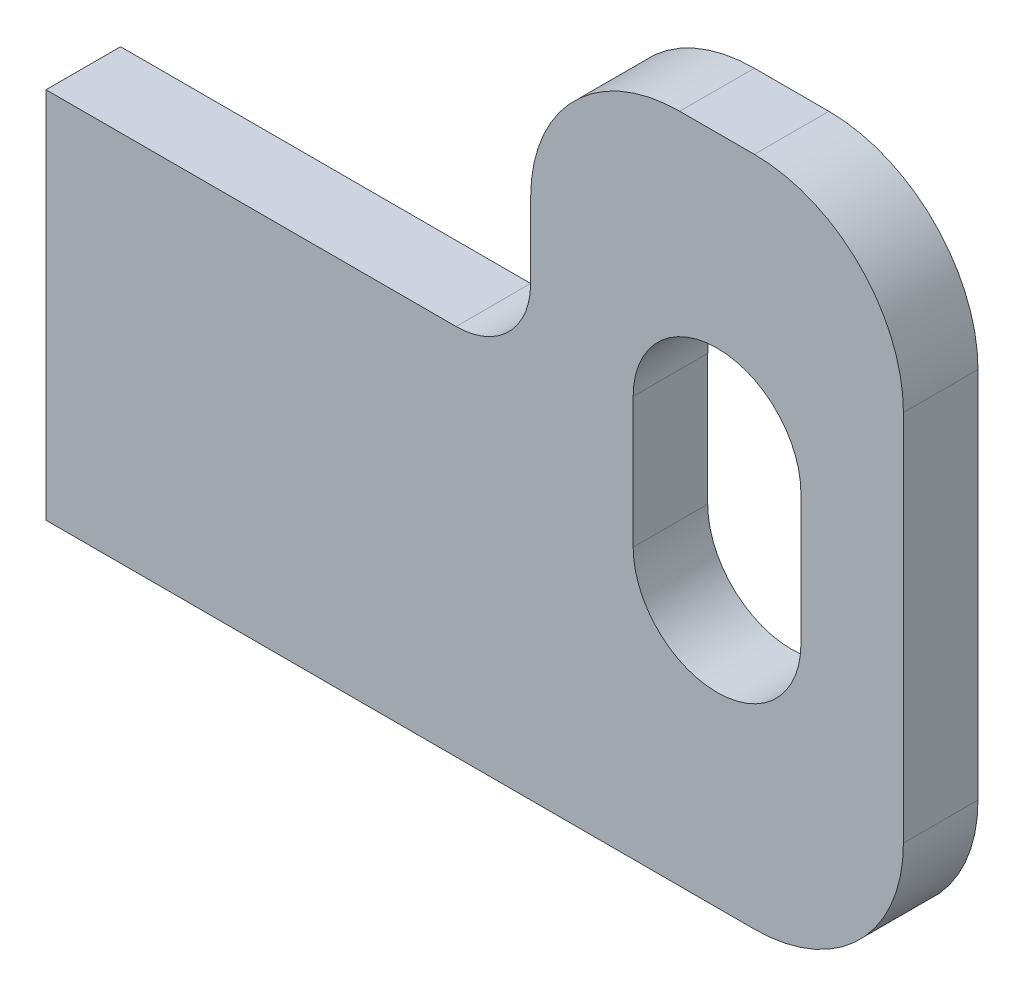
ISO-10303-21;
HEADER;
FILE_DESCRIPTION(('STEP AP214'),'2;1');
FILE_NAME('part.step','',(''),(''),'','','');
FILE_SCHEMA(('AUTOMOTIVE_DESIGN { 1 0 10303 214 1 1 1 1 }'));
ENDSEC;
DATA;
#1=APPLICATION_CONTEXT('core data for automotive mechanical design processes');
#2=APPLICATION_PROTOCOL_DEFINITION('international standard','automotive_design',2000,#1);
#3=PRODUCT_CONTEXT('',#1,'mechanical');
#4=PRODUCT('Part','Part','',(#3));
#5=PRODUCT_RELATED_PRODUCT_CATEGORY('part','',(#4));
#6=PRODUCT_DEFINITION_FORMATION('','',#4);
#7=PRODUCT_DEFINITION_CONTEXT('part definition',#1,'design');
#8=PRODUCT_DEFINITION('design','',#6,#7);
#9=PRODUCT_DEFINITION_SHAPE('','',#8);
#10=(LENGTH_UNIT() NAMED_UNIT(*) SI_UNIT(.MILLI.,.METRE.));
#11=(NAMED_UNIT(*) PLANE_ANGLE_UNIT() SI_UNIT($,.RADIAN.));
#12=(NAMED_UNIT(*) SI_UNIT($,.STERADIAN.) SOLID_ANGLE_UNIT());
#13=UNCERTAINTY_MEASURE_WITH_UNIT(LENGTH_MEASURE(1.E-05),#10,'distance_accuracy_value','');
#14=(GEOMETRIC_REPRESENTATION_CONTEXT(3) GLOBAL_UNCERTAINTY_ASSIGNED_CONTEXT((#13)) GLOBAL_UNIT_ASSIGNED_CONTEXT((#10,
#11,#12)) REPRESENTATION_CONTEXT('',''));
#15=CARTESIAN_POINT('',(0.,0.,0.));
#16=DIRECTION('',(0.,0.,1.));
#17=DIRECTION('',(1.,0.,0.));
#18=AXIS2_PLACEMENT_3D('',#15,#16,#17);
#19=CARTESIAN_POINT('',(264.741762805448,163.075378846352,6.35000000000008));
#20=DIRECTION('',(0.,0.,1.));
#21=DIRECTION('',(1.,0.,0.));
#22=AXIS2_PLACEMENT_3D('',#19,#20,#21);
#23=PLANE('',#22);
#24=CARTESIAN_POINT('',(264.741762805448,163.075378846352,6.35000000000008));
#25=DIRECTION('',(0.,0.,-1.));
#26=DIRECTION('',(1.,0.,0.));
#27=AXIS2_PLACEMENT_3D('',#24,#25,#26);
#28=CIRCLE('',#27,6.35000000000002);
#29=CARTESIAN_POINT('',(271.091762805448,163.075378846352,6.35000000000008));
#30=VERTEX_POINT('',#29);
#31=CARTESIAN_POINT('',(264.741762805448,156.725378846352,6.35000000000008));
#32=VERTEX_POINT('',#31);
#33=EDGE_CURVE('E169',#30,#32,#28,.T.);
#34=ORIENTED_EDGE('',*,*,#33,.T.);
#35=DIRECTION('',(-1.,0.,0.));
#36=VECTOR('',#35,1.);
#37=CARTESIAN_POINT('',(264.741762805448,156.725378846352,6.35000000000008));
#38=LINE('',#37,#36);
#39=CARTESIAN_POINT('',(229.816762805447,156.725378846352,6.34999999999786));
#40=VERTEX_POINT('',#39);
#41=EDGE_CURVE('E172',#32,#40,#38,.T.);
#42=ORIENTED_EDGE('',*,*,#41,.T.);
#43=DIRECTION('',(0.,-1.,0.));
#44=VECTOR('',#43,1.);
#45=CARTESIAN_POINT('',(229.816762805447,156.725378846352,6.34999999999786));
#46=LINE('',#45,#44);
#47=CARTESIAN_POINT('',(229.816762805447,124.975378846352,6.34999999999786));
#48=VERTEX_POINT('',#47);
#49=EDGE_CURVE('E175',#40,#48,#46,.T.);
#50=ORIENTED_EDGE('',*,*,#49,.T.);
#51=DIRECTION('',(1.,0.,0.));
#52=VECTOR('',#51,1.);
#53=CARTESIAN_POINT('',(229.816762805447,124.975378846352,6.34999999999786));
#54=LINE('',#53,#52);
#55=CARTESIAN_POINT('',(290.141762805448,124.975378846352,6.35000000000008));
#56=VERTEX_POINT('',#55);
#57=EDGE_CURVE('E177',#48,#56,#54,.T.);
#58=ORIENTED_EDGE('',*,*,#57,.T.);
#59=CARTESIAN_POINT('',(290.141762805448,137.675378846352,6.35000000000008));
#60=DIRECTION('',(0.,0.,1.));
#61=DIRECTION('',(1.,0.,0.));
#62=AXIS2_PLACEMENT_3D('',#59,#60,#61);
#63=CIRCLE('',#62,12.7);
#64=CARTESIAN_POINT('',(302.841762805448,137.675378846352,6.35000000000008));
#65=VERTEX_POINT('',#64);
#66=EDGE_CURVE('E179',#56,#65,#63,.T.);
#67=ORIENTED_EDGE('',*,*,#66,.T.);
#68=DIRECTION('',(0.,1.,0.));
#69=VECTOR('',#68,1.);
#70=CARTESIAN_POINT('',(302.841762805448,137.675378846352,6.35000000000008));
#71=LINE('',#70,#69);
#72=CARTESIAN_POINT('',(302.841762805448,169.425378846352,6.35000000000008));
#73=VERTEX_POINT('',#72);
#74=EDGE_CURVE('E181',#65,#73,#71,.T.);
#75=ORIENTED_EDGE('',*,*,#74,.T.);
#76=CARTESIAN_POINT('',(290.141762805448,169.425378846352,6.35000000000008));
#77=DIRECTION('',(0.,0.,1.));
#78=DIRECTION('',(1.,0.,0.));
#79=AXIS2_PLACEMENT_3D('',#76,#77,#78);
#80=CIRCLE('',#79,12.7);
#81=CARTESIAN_POINT('',(290.141762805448,182.125378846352,6.35000000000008));
#82=VERTEX_POINT('',#81);
#83=EDGE_CURVE('E183',#73,#82,#80,.T.);
#84=ORIENTED_EDGE('',*,*,#83,.T.);
#85=DIRECTION('',(-1.,0.,0.));
#86=VECTOR('',#85,1.);
#87=CARTESIAN_POINT('',(290.141762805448,182.125378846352,6.35000000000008));
#88=LINE('',#87,#86);
#89=CARTESIAN_POINT('',(283.791762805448,182.125378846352,6.35000000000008));
#90=VERTEX_POINT('',#89);
#91=EDGE_CURVE('E185',#82,#90,#88,.T.);
#92=ORIENTED_EDGE('',*,*,#91,.T.);
#93=CARTESIAN_POINT('',(283.791762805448,169.425378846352,6.35000000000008));
#94=DIRECTION('',(0.,0.,1.));
#95=DIRECTION('',(1.,0.,0.));
#96=AXIS2_PLACEMENT_3D('',#93,#94,#95);
#97=CIRCLE('',#96,12.7);
#98=CARTESIAN_POINT('',(271.091762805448,169.425378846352,6.35000000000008));
#99=VERTEX_POINT('',#98);
#100=EDGE_CURVE('E187',#90,#99,#97,.T.);
#101=ORIENTED_EDGE('',*,*,#100,.T.);
#102=DIRECTION('',(0.,-1.,0.));
#103=VECTOR('',#102,1.);
#104=CARTESIAN_POINT('',(271.091762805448,169.425378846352,6.35000000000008));
#105=LINE('',#104,#103);
#106=EDGE_CURVE('E189',#99,#30,#105,.T.);
#107=ORIENTED_EDGE('',*,*,#106,.T.);
#108=EDGE_LOOP('',(#34,#42,#50,#58,#67,#75,#84,#92,#101,#107));
#109=FACE_BOUND('',#108,.T.);
#110=DIRECTION('',(0.,1.,0.));
#111=VECTOR('',#110,1.);
#112=CARTESIAN_POINT('',(294.111053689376,147.993152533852,6.35000000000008));
#113=LINE('',#112,#111);
#114=CARTESIAN_POINT('',(294.111053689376,147.993152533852,6.35000000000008));
#115=VERTEX_POINT('',#114);
#116=CARTESIAN_POINT('',(294.111053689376,159.105652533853,6.35000000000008));
#117=VERTEX_POINT('',#116);
#118=EDGE_CURVE('E141',#115,#117,#113,.T.);
#119=ORIENTED_EDGE('',*,*,#118,.F.);
#120=CARTESIAN_POINT('',(286.967303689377,147.993152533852,6.35000000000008));
#121=DIRECTION('',(0.,0.,1.));
#122=DIRECTION('',(1.,0.,0.));
#123=AXIS2_PLACEMENT_3D('',#120,#121,#122);
#124=CIRCLE('',#123,7.14374999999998);
#125=CARTESIAN_POINT('',(279.823553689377,147.993152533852,6.35000000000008));
#126=VERTEX_POINT('',#125);
#127=EDGE_CURVE('E133',#126,#115,#124,.T.);
#128=ORIENTED_EDGE('',*,*,#127,.F.);
#129=DIRECTION('',(0.,-1.,0.));
#130=VECTOR('',#129,1.);
#131=CARTESIAN_POINT('',(279.823553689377,159.105652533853,6.35000000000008));
#132=LINE('',#131,#130);
#133=CARTESIAN_POINT('',(279.823553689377,159.105652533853,6.35000000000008));
#134=VERTEX_POINT('',#133);
#135=EDGE_CURVE('E155',#134,#126,#132,.T.);
#136=ORIENTED_EDGE('',*,*,#135,.F.);
#137=CARTESIAN_POINT('',(286.967303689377,159.105652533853,6.35000000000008));
#138=DIRECTION('',(0.,0.,1.));
#139=DIRECTION('',(1.,0.,0.));
#140=AXIS2_PLACEMENT_3D('',#137,#138,#139);
#141=CIRCLE('',#140,7.14374999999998);
#142=EDGE_CURVE('E153',#117,#134,#141,.T.);
#143=ORIENTED_EDGE('',*,*,#142,.F.);
#144=EDGE_LOOP('',(#119,#128,#136,#143));
#145=FACE_BOUND('',#144,.T.);
#146=ADVANCED_FACE('F32',(#109,#145),#23,.T.);
#147=CARTESIAN_POINT('',(264.741762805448,163.075378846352,0.));
#148=DIRECTION('',(0.,0.,1.));
#149=DIRECTION('',(1.,0.,0.));
#150=AXIS2_PLACEMENT_3D('',#147,#148,#149);
#151=PLANE('',#150);
#152=CARTESIAN_POINT('',(264.741762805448,163.075378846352,0.));
#153=DIRECTION('',(0.,0.,-1.));
#154=DIRECTION('',(1.,0.,0.));
#155=AXIS2_PLACEMENT_3D('',#152,#153,#154);
#156=CIRCLE('',#155,6.35000000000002);
#157=CARTESIAN_POINT('',(271.091762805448,163.075378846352,0.));
#158=VERTEX_POINT('',#157);
#159=CARTESIAN_POINT('',(264.741762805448,156.725378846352,0.));
#160=VERTEX_POINT('',#159);
#161=EDGE_CURVE('E149',#158,#160,#156,.T.);
#162=ORIENTED_EDGE('',*,*,#161,.F.);
#163=DIRECTION('',(0.,-1.,0.));
#164=VECTOR('',#163,1.);
#165=CARTESIAN_POINT('',(271.091762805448,169.425378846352,0.));
#166=LINE('',#165,#164);
#167=CARTESIAN_POINT('',(271.091762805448,169.425378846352,0.));
#168=VERTEX_POINT('',#167);
#169=EDGE_CURVE('E173',#168,#158,#166,.T.);
#170=ORIENTED_EDGE('',*,*,#169,.F.);
#171=CARTESIAN_POINT('',(283.791762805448,169.425378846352,0.));
#172=DIRECTION('',(0.,0.,1.));
#173=DIRECTION('',(1.,0.,0.));
#174=AXIS2_PLACEMENT_3D('',#171,#172,#173);
#175=CIRCLE('',#174,12.7);
#176=CARTESIAN_POINT('',(283.791762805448,182.125378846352,0.));
#177=VERTEX_POINT('',#176);
#178=EDGE_CURVE('E208',#177,#168,#175,.T.);
#179=ORIENTED_EDGE('',*,*,#178,.F.);
#180=DIRECTION('',(-1.,0.,0.));
#181=VECTOR('',#180,1.);
#182=CARTESIAN_POINT('',(290.141762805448,182.125378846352,0.));
#183=LINE('',#182,#181);
#184=CARTESIAN_POINT('',(290.141762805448,182.125378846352,0.));
#185=VERTEX_POINT('',#184);
#186=EDGE_CURVE('E206',#185,#177,#183,.T.);
#187=ORIENTED_EDGE('',*,*,#186,.F.);
#188=CARTESIAN_POINT('',(290.141762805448,169.425378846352,0.));
#189=DIRECTION('',(0.,0.,1.));
#190=DIRECTION('',(1.,0.,0.));
#191=AXIS2_PLACEMENT_3D('',#188,#189,#190);
#192=CIRCLE('',#191,12.7);
#193=CARTESIAN_POINT('',(302.841762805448,169.425378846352,0.));
#194=VERTEX_POINT('',#193);
#195=EDGE_CURVE('E204',#194,#185,#192,.T.);
#196=ORIENTED_EDGE('',*,*,#195,.F.);
#197=DIRECTION('',(0.,1.,0.));
#198=VECTOR('',#197,1.);
#199=CARTESIAN_POINT('',(302.841762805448,137.675378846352,0.));
#200=LINE('',#199,#198);
#201=CARTESIAN_POINT('',(302.841762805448,137.675378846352,0.));
#202=VERTEX_POINT('',#201);
#203=EDGE_CURVE('E202',#202,#194,#200,.T.);
#204=ORIENTED_EDGE('',*,*,#203,.F.);
#205=CARTESIAN_POINT('',(290.141762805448,137.675378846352,0.));
#206=DIRECTION('',(0.,0.,1.));
#207=DIRECTION('',(1.,0.,0.));
#208=AXIS2_PLACEMENT_3D('',#205,#206,#207);
#209=CIRCLE('',#208,12.7);
#210=CARTESIAN_POINT('',(290.141762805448,124.975378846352,0.));
#211=VERTEX_POINT('',#210);
#212=EDGE_CURVE('E200',#211,#202,#209,.T.);
#213=ORIENTED_EDGE('',*,*,#212,.F.);
#214=DIRECTION('',(1.,0.,0.));
#215=VECTOR('',#214,1.);
#216=CARTESIAN_POINT('',(229.816762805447,124.975378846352,-2.22044604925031E-12));
#217=LINE('',#216,#215);
#218=CARTESIAN_POINT('',(229.816762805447,124.975378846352,-2.22044604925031E-12));
#219=VERTEX_POINT('',#218);
#220=EDGE_CURVE('E198',#219,#211,#217,.T.);
#221=ORIENTED_EDGE('',*,*,#220,.F.);
#222=DIRECTION('',(0.,-1.,0.));
#223=VECTOR('',#222,1.);
#224=CARTESIAN_POINT('',(229.816762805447,156.725378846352,-2.22044604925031E-12));
#225=LINE('',#224,#223);
#226=CARTESIAN_POINT('',(229.816762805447,156.725378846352,-2.22044604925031E-12));
#227=VERTEX_POINT('',#226);
#228=EDGE_CURVE('E196',#227,#219,#225,.T.);
#229=ORIENTED_EDGE('',*,*,#228,.F.);
#230=DIRECTION('',(-1.,0.,0.));
#231=VECTOR('',#230,1.);
#232=CARTESIAN_POINT('',(264.741762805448,156.725378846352,0.));
#233=LINE('',#232,#231);
#234=EDGE_CURVE('E194',#160,#227,#233,.T.);
#235=ORIENTED_EDGE('',*,*,#234,.F.);
#236=EDGE_LOOP('',(#162,#170,#179,#187,#196,#204,#213,#221,#229,#235));
#237=FACE_BOUND('',#236,.T.);
#238=CARTESIAN_POINT('',(286.967303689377,147.993152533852,0.));
#239=DIRECTION('',(0.,0.,1.));
#240=DIRECTION('',(1.,0.,0.));
#241=AXIS2_PLACEMENT_3D('',#238,#239,#240);
#242=CIRCLE('',#241,7.14374999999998);
#243=CARTESIAN_POINT('',(279.823553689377,147.993152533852,0.));
#244=VERTEX_POINT('',#243);
#245=CARTESIAN_POINT('',(294.111053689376,147.993152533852,0.));
#246=VERTEX_POINT('',#245);
#247=EDGE_CURVE('E55',#244,#246,#242,.T.);
#248=ORIENTED_EDGE('',*,*,#247,.T.);
#249=DIRECTION('',(0.,1.,0.));
#250=VECTOR('',#249,1.);
#251=CARTESIAN_POINT('',(294.111053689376,147.993152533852,0.));
#252=LINE('',#251,#250);
#253=CARTESIAN_POINT('',(294.111053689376,159.105652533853,0.));
#254=VERTEX_POINT('',#253);
#255=EDGE_CURVE('E148',#246,#254,#252,.T.);
#256=ORIENTED_EDGE('',*,*,#255,.T.);
#257=CARTESIAN_POINT('',(286.967303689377,159.105652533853,0.));
#258=DIRECTION('',(0.,0.,1.));
#259=DIRECTION('',(1.,0.,0.));
#260=AXIS2_PLACEMENT_3D('',#257,#258,#259);
#261=CIRCLE('',#260,7.14374999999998);
#262=CARTESIAN_POINT('',(279.823553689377,159.105652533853,0.));
#263=VERTEX_POINT('',#262);
#264=EDGE_CURVE('E161',#254,#263,#261,.T.);
#265=ORIENTED_EDGE('',*,*,#264,.T.);
#266=DIRECTION('',(0.,-1.,0.));
#267=VECTOR('',#266,1.);
#268=CARTESIAN_POINT('',(279.823553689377,159.105652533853,0.));
#269=LINE('',#268,#267);
#270=EDGE_CURVE('E142',#263,#244,#269,.T.);
#271=ORIENTED_EDGE('',*,*,#270,.T.);
#272=EDGE_LOOP('',(#248,#256,#265,#271));
#273=FACE_BOUND('',#272,.T.);
#274=ADVANCED_FACE('F244',(#237,#273),#151,.F.);
#275=CARTESIAN_POINT('',(264.741762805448,163.075378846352,6.35000000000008));
#276=DIRECTION('',(0.,0.,-1.));
#277=DIRECTION('',(-1.,0.,0.));
#278=AXIS2_PLACEMENT_3D('',#275,#276,#277);
#279=CYLINDRICAL_SURFACE('',#278,6.35000000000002);
#280=ORIENTED_EDGE('',*,*,#161,.T.);
#281=DIRECTION('',(0.,0.,-1.));
#282=VECTOR('',#281,1.);
#283=CARTESIAN_POINT('',(264.741762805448,156.725378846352,6.35000000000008));
#284=LINE('',#283,#282);
#285=EDGE_CURVE('E11',#32,#160,#284,.T.);
#286=ORIENTED_EDGE('',*,*,#285,.F.);
#287=ORIENTED_EDGE('',*,*,#33,.F.);
#288=DIRECTION('',(0.,0.,-1.));
#289=VECTOR('',#288,1.);
#290=CARTESIAN_POINT('',(271.091762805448,163.075378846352,6.35000000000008));
#291=LINE('',#290,#289);
#292=EDGE_CURVE('E191',#30,#158,#291,.T.);
#293=ORIENTED_EDGE('',*,*,#292,.T.);
#294=EDGE_LOOP('',(#280,#286,#287,#293));
#295=FACE_BOUND('',#294,.T.);
#296=ADVANCED_FACE('F34',(#295),#279,.F.);
#297=CARTESIAN_POINT('',(264.741762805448,156.725378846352,6.35000000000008));
#298=DIRECTION('',(0.,-1.,0.));
#299=DIRECTION('',(1.,0.,0.));
#300=AXIS2_PLACEMENT_3D('',#297,#298,#299);
#301=PLANE('',#300);
#302=ORIENTED_EDGE('',*,*,#234,.T.);
#303=DIRECTION('',(0.,0.,-1.));
#304=VECTOR('',#303,1.);
#305=CARTESIAN_POINT('',(229.816762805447,156.725378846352,6.34999999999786));
#306=LINE('',#305,#304);
#307=EDGE_CURVE('E40',#40,#227,#306,.T.);
#308=ORIENTED_EDGE('',*,*,#307,.F.);
#309=ORIENTED_EDGE('',*,*,#41,.F.);
#310=ORIENTED_EDGE('',*,*,#285,.T.);
#311=EDGE_LOOP('',(#302,#308,#309,#310));
#312=FACE_BOUND('',#311,.T.);
#313=ADVANCED_FACE('F261',(#312),#301,.F.);
#314=CARTESIAN_POINT('',(229.816762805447,156.725378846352,6.34999999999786));
#315=DIRECTION('',(1.,0.,0.));
#316=DIRECTION('',(0.,0.,-1.));
#317=AXIS2_PLACEMENT_3D('',#314,#315,#316);
#318=PLANE('',#317);
#319=ORIENTED_EDGE('',*,*,#228,.T.);
#320=DIRECTION('',(0.,0.,-1.));
#321=VECTOR('',#320,1.);
#322=CARTESIAN_POINT('',(229.816762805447,124.975378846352,6.34999999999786));
#323=LINE('',#322,#321);
#324=EDGE_CURVE('E231',#48,#219,#323,.T.);
#325=ORIENTED_EDGE('',*,*,#324,.F.);
#326=ORIENTED_EDGE('',*,*,#49,.F.);
#327=ORIENTED_EDGE('',*,*,#307,.T.);
#328=EDGE_LOOP('',(#319,#325,#326,#327));
#329=FACE_BOUND('',#328,.T.);
#330=ADVANCED_FACE('F238',(#329),#318,.F.);
#331=CARTESIAN_POINT('',(229.816762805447,124.975378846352,6.34999999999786));
#332=DIRECTION('',(0.,1.,0.));
#333=DIRECTION('',(-1.,0.,0.));
#334=AXIS2_PLACEMENT_3D('',#331,#332,#333);
#335=PLANE('',#334);
#336=ORIENTED_EDGE('',*,*,#220,.T.);
#337=DIRECTION('',(0.,0.,-1.));
#338=VECTOR('',#337,1.);
#339=CARTESIAN_POINT('',(290.141762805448,124.975378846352,6.35000000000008));
#340=LINE('',#339,#338);
#341=EDGE_CURVE('E228',#56,#211,#340,.T.);
#342=ORIENTED_EDGE('',*,*,#341,.F.);
#343=ORIENTED_EDGE('',*,*,#57,.F.);
#344=ORIENTED_EDGE('',*,*,#324,.T.);
#345=EDGE_LOOP('',(#336,#342,#343,#344));
#346=FACE_BOUND('',#345,.T.);
#347=ADVANCED_FACE('F250',(#346),#335,.F.);
#348=CARTESIAN_POINT('',(290.141762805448,137.675378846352,6.35000000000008));
#349=DIRECTION('',(0.,0.,-1.));
#350=DIRECTION('',(-1.,0.,0.));
#351=AXIS2_PLACEMENT_3D('',#348,#349,#350);
#352=CYLINDRICAL_SURFACE('',#351,12.7);
#353=ORIENTED_EDGE('',*,*,#212,.T.);
#354=DIRECTION('',(0.,0.,-1.));
#355=VECTOR('',#354,1.);
#356=CARTESIAN_POINT('',(302.841762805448,137.675378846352,6.35000000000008));
#357=LINE('',#356,#355);
#358=EDGE_CURVE('E225',#65,#202,#357,.T.);
#359=ORIENTED_EDGE('',*,*,#358,.F.);
#360=ORIENTED_EDGE('',*,*,#66,.F.);
#361=ORIENTED_EDGE('',*,*,#341,.T.);
#362=EDGE_LOOP('',(#353,#359,#360,#361));
#363=FACE_BOUND('',#362,.T.);
#364=ADVANCED_FACE('F254',(#363),#352,.T.);
#365=CARTESIAN_POINT('',(302.841762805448,137.675378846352,6.35000000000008));
#366=DIRECTION('',(-1.,0.,0.));
#367=DIRECTION('',(0.,0.,1.));
#368=AXIS2_PLACEMENT_3D('',#365,#366,#367);
#369=PLANE('',#368);
#370=ORIENTED_EDGE('',*,*,#203,.T.);
#371=DIRECTION('',(0.,0.,-1.));
#372=VECTOR('',#371,1.);
#373=CARTESIAN_POINT('',(302.841762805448,169.425378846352,6.35000000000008));
#374=LINE('',#373,#372);
#375=EDGE_CURVE('E222',#73,#194,#374,.T.);
#376=ORIENTED_EDGE('',*,*,#375,.F.);
#377=ORIENTED_EDGE('',*,*,#74,.F.);
#378=ORIENTED_EDGE('',*,*,#358,.T.);
#379=EDGE_LOOP('',(#370,#376,#377,#378));
#380=FACE_BOUND('',#379,.T.);
#381=ADVANCED_FACE('F284',(#380),#369,.F.);
#382=CARTESIAN_POINT('',(290.141762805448,169.425378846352,6.35000000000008));
#383=DIRECTION('',(0.,0.,-1.));
#384=DIRECTION('',(-1.,0.,0.));
#385=AXIS2_PLACEMENT_3D('',#382,#383,#384);
#386=CYLINDRICAL_SURFACE('',#385,12.7);
#387=ORIENTED_EDGE('',*,*,#195,.T.);
#388=DIRECTION('',(0.,0.,-1.));
#389=VECTOR('',#388,1.);
#390=CARTESIAN_POINT('',(290.141762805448,182.125378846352,6.35000000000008));
#391=LINE('',#390,#389);
#392=EDGE_CURVE('E219',#82,#185,#391,.T.);
#393=ORIENTED_EDGE('',*,*,#392,.F.);
#394=ORIENTED_EDGE('',*,*,#83,.F.);
#395=ORIENTED_EDGE('',*,*,#375,.T.);
#396=EDGE_LOOP('',(#387,#393,#394,#395));
#397=FACE_BOUND('',#396,.T.);
#398=ADVANCED_FACE('F281',(#397),#386,.T.);
#399=CARTESIAN_POINT('',(290.141762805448,182.125378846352,6.35000000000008));
#400=DIRECTION('',(0.,-1.,0.));
#401=DIRECTION('',(0.,0.,-1.));
#402=AXIS2_PLACEMENT_3D('',#399,#400,#401);
#403=PLANE('',#402);
#404=ORIENTED_EDGE('',*,*,#186,.T.);
#405=DIRECTION('',(0.,0.,-1.));
#406=VECTOR('',#405,1.);
#407=CARTESIAN_POINT('',(283.791762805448,182.125378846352,6.35000000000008));
#408=LINE('',#407,#406);
#409=EDGE_CURVE('E216',#90,#177,#408,.T.);
#410=ORIENTED_EDGE('',*,*,#409,.F.);
#411=ORIENTED_EDGE('',*,*,#91,.F.);
#412=ORIENTED_EDGE('',*,*,#392,.T.);
#413=EDGE_LOOP('',(#404,#410,#411,#412));
#414=FACE_BOUND('',#413,.T.);
#415=ADVANCED_FACE('F277',(#414),#403,.F.);
#416=CARTESIAN_POINT('',(283.791762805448,169.425378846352,6.35000000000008));
#417=DIRECTION('',(0.,0.,-1.));
#418=DIRECTION('',(-1.,0.,0.));
#419=AXIS2_PLACEMENT_3D('',#416,#417,#418);
#420=CYLINDRICAL_SURFACE('',#419,12.7);
#421=ORIENTED_EDGE('',*,*,#178,.T.);
#422=DIRECTION('',(0.,0.,-1.));
#423=VECTOR('',#422,1.);
#424=CARTESIAN_POINT('',(271.091762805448,169.425378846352,6.35000000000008));
#425=LINE('',#424,#423);
#426=EDGE_CURVE('E213',#99,#168,#425,.T.);
#427=ORIENTED_EDGE('',*,*,#426,.F.);
#428=ORIENTED_EDGE('',*,*,#100,.F.);
#429=ORIENTED_EDGE('',*,*,#409,.T.);
#430=EDGE_LOOP('',(#421,#427,#428,#429));
#431=FACE_BOUND('',#430,.T.);
#432=ADVANCED_FACE('F273',(#431),#420,.T.);
#433=CARTESIAN_POINT('',(271.091762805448,169.425378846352,6.35000000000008));
#434=DIRECTION('',(1.,0.,0.));
#435=DIRECTION('',(0.,0.,-1.));
#436=AXIS2_PLACEMENT_3D('',#433,#434,#435);
#437=PLANE('',#436);
#438=ORIENTED_EDGE('',*,*,#169,.T.);
#439=ORIENTED_EDGE('',*,*,#292,.F.);
#440=ORIENTED_EDGE('',*,*,#106,.F.);
#441=ORIENTED_EDGE('',*,*,#426,.T.);
#442=EDGE_LOOP('',(#438,#439,#440,#441));
#443=FACE_BOUND('',#442,.T.);
#444=ADVANCED_FACE('F268',(#443),#437,.F.);
#445=CARTESIAN_POINT('',(286.967303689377,147.993152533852,6.35000000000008));
#446=DIRECTION('',(0.,0.,-1.));
#447=DIRECTION('',(-1.,0.,0.));
#448=AXIS2_PLACEMENT_3D('',#445,#446,#447);
#449=CYLINDRICAL_SURFACE('',#448,7.14374999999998);
#450=ORIENTED_EDGE('',*,*,#247,.F.);
#451=DIRECTION('',(0.,0.,-1.));
#452=VECTOR('',#451,1.);
#453=CARTESIAN_POINT('',(279.823553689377,147.993152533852,6.35000000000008));
#454=LINE('',#453,#452);
#455=EDGE_CURVE('E137',#126,#244,#454,.T.);
#456=ORIENTED_EDGE('',*,*,#455,.F.);
#457=ORIENTED_EDGE('',*,*,#127,.T.);
#458=DIRECTION('',(0.,0.,-1.));
#459=VECTOR('',#458,1.);
#460=CARTESIAN_POINT('',(294.111053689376,147.993152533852,6.35000000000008));
#461=LINE('',#460,#459);
#462=EDGE_CURVE('E136',#115,#246,#461,.T.);
#463=ORIENTED_EDGE('',*,*,#462,.T.);
#464=EDGE_LOOP('',(#450,#456,#457,#463));
#465=FACE_BOUND('',#464,.T.);
#466=ADVANCED_FACE('F135',(#465),#449,.F.);
#467=CARTESIAN_POINT('',(294.111053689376,147.993152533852,6.35000000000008));
#468=DIRECTION('',(-1.,0.,0.));
#469=DIRECTION('',(0.,0.,1.));
#470=AXIS2_PLACEMENT_3D('',#467,#468,#469);
#471=PLANE('',#470);
#472=ORIENTED_EDGE('',*,*,#255,.F.);
#473=ORIENTED_EDGE('',*,*,#462,.F.);
#474=ORIENTED_EDGE('',*,*,#118,.T.);
#475=DIRECTION('',(0.,0.,-1.));
#476=VECTOR('',#475,1.);
#477=CARTESIAN_POINT('',(294.111053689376,159.105652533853,6.35000000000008));
#478=LINE('',#477,#476);
#479=EDGE_CURVE('E150',#117,#254,#478,.T.);
#480=ORIENTED_EDGE('',*,*,#479,.T.);
#481=EDGE_LOOP('',(#472,#473,#474,#480));
#482=FACE_BOUND('',#481,.T.);
#483=ADVANCED_FACE('F145',(#482),#471,.T.);
#484=CARTESIAN_POINT('',(286.967303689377,159.105652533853,6.35000000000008));
#485=DIRECTION('',(0.,0.,-1.));
#486=DIRECTION('',(-1.,0.,0.));
#487=AXIS2_PLACEMENT_3D('',#484,#485,#486);
#488=CYLINDRICAL_SURFACE('',#487,7.14374999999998);
#489=ORIENTED_EDGE('',*,*,#264,.F.);
#490=ORIENTED_EDGE('',*,*,#479,.F.);
#491=ORIENTED_EDGE('',*,*,#142,.T.);
#492=DIRECTION('',(0.,0.,-1.));
#493=VECTOR('',#492,1.);
#494=CARTESIAN_POINT('',(279.823553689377,159.105652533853,6.35000000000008));
#495=LINE('',#494,#493);
#496=EDGE_CURVE('E47',#134,#263,#495,.T.);
#497=ORIENTED_EDGE('',*,*,#496,.T.);
#498=EDGE_LOOP('',(#489,#490,#491,#497));
#499=FACE_BOUND('',#498,.T.);
#500=ADVANCED_FACE('F330',(#499),#488,.F.);
#501=CARTESIAN_POINT('',(279.823553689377,159.105652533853,6.35000000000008));
#502=DIRECTION('',(1.,0.,0.));
#503=DIRECTION('',(0.,0.,-1.));
#504=AXIS2_PLACEMENT_3D('',#501,#502,#503);
#505=PLANE('',#504);
#506=ORIENTED_EDGE('',*,*,#270,.F.);
#507=ORIENTED_EDGE('',*,*,#496,.F.);
#508=ORIENTED_EDGE('',*,*,#135,.T.);
#509=ORIENTED_EDGE('',*,*,#455,.T.);
#510=EDGE_LOOP('',(#506,#507,#508,#509));
#511=FACE_BOUND('',#510,.T.);
#512=ADVANCED_FACE('F336',(#511),#505,.T.);
#513=CLOSED_SHELL('',(#146,#274,#296,#313,#330,#347,#364,#381,#398,#415,#432,#444,#466,#483,
#500,#512));
#514=MANIFOLD_SOLID_BREP('B2',#513);
#515=ADVANCED_BREP_SHAPE_REPRESENTATION('',(#18,#514),#14);
#516=SHAPE_DEFINITION_REPRESENTATION(#9,#515);
ENDSEC;
END-ISO-10303-21;
